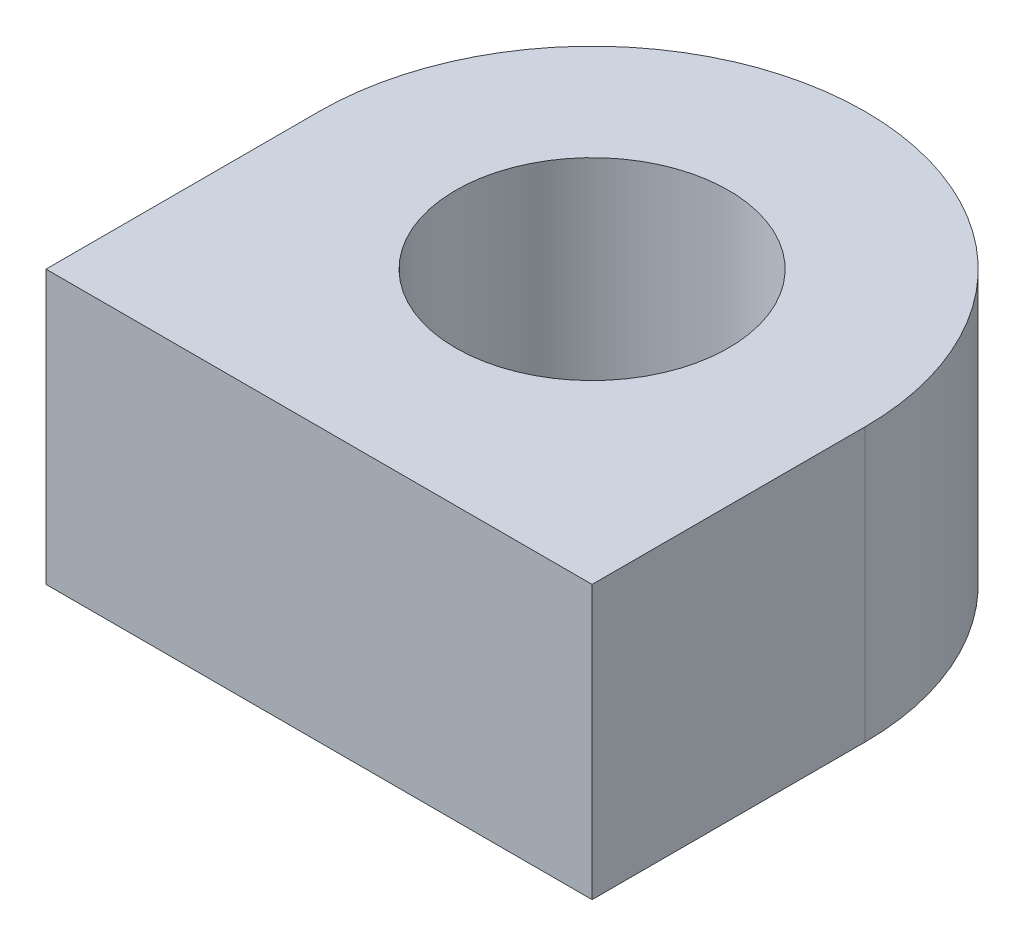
ISO-10303-21;
HEADER;
FILE_DESCRIPTION(('STEP AP214'),'2;1');
FILE_NAME('part.step','',(''),(''),'','','');
FILE_SCHEMA(('AUTOMOTIVE_DESIGN { 1 0 10303 214 1 1 1 1 }'));
ENDSEC;
DATA;
#1=APPLICATION_CONTEXT('core data for automotive mechanical design processes');
#2=APPLICATION_PROTOCOL_DEFINITION('international standard','automotive_design',2000,#1);
#3=PRODUCT_CONTEXT('',#1,'mechanical');
#4=PRODUCT('Part','Part','',(#3));
#5=PRODUCT_RELATED_PRODUCT_CATEGORY('part','',(#4));
#6=PRODUCT_DEFINITION_FORMATION('','',#4);
#7=PRODUCT_DEFINITION_CONTEXT('part definition',#1,'design');
#8=PRODUCT_DEFINITION('design','',#6,#7);
#9=PRODUCT_DEFINITION_SHAPE('','',#8);
#10=(LENGTH_UNIT() NAMED_UNIT(*) SI_UNIT(.MILLI.,.METRE.));
#11=(NAMED_UNIT(*) PLANE_ANGLE_UNIT() SI_UNIT($,.RADIAN.));
#12=(NAMED_UNIT(*) SI_UNIT($,.STERADIAN.) SOLID_ANGLE_UNIT());
#13=UNCERTAINTY_MEASURE_WITH_UNIT(LENGTH_MEASURE(1.E-05),#10,'distance_accuracy_value','');
#14=(GEOMETRIC_REPRESENTATION_CONTEXT(3) GLOBAL_UNCERTAINTY_ASSIGNED_CONTEXT((#13)) GLOBAL_UNIT_ASSIGNED_CONTEXT((#10,
#11,#12)) REPRESENTATION_CONTEXT('',''));
#15=CARTESIAN_POINT('',(0.,0.,0.));
#16=DIRECTION('',(0.,0.,1.));
#17=DIRECTION('',(1.,0.,0.));
#18=AXIS2_PLACEMENT_3D('',#15,#16,#17);
#19=CARTESIAN_POINT('',(0.,1.5875,0.));
#20=DIRECTION('',(0.,1.,0.));
#21=DIRECTION('',(0.,0.,1.));
#22=AXIS2_PLACEMENT_3D('',#19,#20,#21);
#23=PLANE('',#22);
#24=CARTESIAN_POINT('',(0.,1.5875,0.));
#25=DIRECTION('',(0.,1.,0.));
#26=DIRECTION('',(0.,0.,1.));
#27=AXIS2_PLACEMENT_3D('',#24,#25,#26);
#28=CIRCLE('',#27,1.5875);
#29=CARTESIAN_POINT('',(1.5875,1.5875,0.));
#30=VERTEX_POINT('',#29);
#31=CARTESIAN_POINT('',(-1.5875,1.5875,0.));
#32=VERTEX_POINT('',#31);
#33=EDGE_CURVE('E90',#30,#32,#28,.T.);
#34=ORIENTED_EDGE('',*,*,#33,.T.);
#35=DIRECTION('',(0.,0.,1.));
#36=VECTOR('',#35,1.);
#37=CARTESIAN_POINT('',(-1.5875,1.5875,0.));
#38=LINE('',#37,#36);
#39=CARTESIAN_POINT('',(-1.5875,1.5875,1.5875));
#40=VERTEX_POINT('',#39);
#41=EDGE_CURVE('E85',#32,#40,#38,.T.);
#42=ORIENTED_EDGE('',*,*,#41,.T.);
#43=DIRECTION('',(1.,0.,0.));
#44=VECTOR('',#43,1.);
#45=CARTESIAN_POINT('',(-1.5875,1.5875,1.5875));
#46=LINE('',#45,#44);
#47=CARTESIAN_POINT('',(1.5875,1.5875,1.5875));
#48=VERTEX_POINT('',#47);
#49=EDGE_CURVE('E88',#40,#48,#46,.T.);
#50=ORIENTED_EDGE('',*,*,#49,.T.);
#51=DIRECTION('',(0.,0.,-1.));
#52=VECTOR('',#51,1.);
#53=CARTESIAN_POINT('',(1.5875,1.5875,1.5875));
#54=LINE('',#53,#52);
#55=EDGE_CURVE('E56',#48,#30,#54,.T.);
#56=ORIENTED_EDGE('',*,*,#55,.T.);
#57=EDGE_LOOP('',(#34,#42,#50,#56));
#58=FACE_BOUND('',#57,.T.);
#59=CARTESIAN_POINT('',(0.,1.5875,0.));
#60=DIRECTION('',(0.,1.,0.));
#61=DIRECTION('',(0.,0.,1.));
#62=AXIS2_PLACEMENT_3D('',#59,#60,#61);
#63=CIRCLE('',#62,0.793749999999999);
#64=CARTESIAN_POINT('',(0.,1.5875,0.793749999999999));
#65=VERTEX_POINT('',#64);
#66=EDGE_CURVE('E106',#65,#65,#63,.T.);
#67=ORIENTED_EDGE('',*,*,#66,.F.);
#68=EDGE_LOOP('',(#67));
#69=FACE_BOUND('',#68,.T.);
#70=ADVANCED_FACE('F39',(#58,#69),#23,.T.);
#71=CARTESIAN_POINT('',(0.,0.,0.));
#72=DIRECTION('',(0.,1.,0.));
#73=DIRECTION('',(0.,0.,1.));
#74=AXIS2_PLACEMENT_3D('',#71,#72,#73);
#75=PLANE('',#74);
#76=CARTESIAN_POINT('',(0.,0.,0.));
#77=DIRECTION('',(0.,1.,0.));
#78=DIRECTION('',(0.,0.,1.));
#79=AXIS2_PLACEMENT_3D('',#76,#77,#78);
#80=CIRCLE('',#79,1.5875);
#81=CARTESIAN_POINT('',(1.5875,0.,0.));
#82=VERTEX_POINT('',#81);
#83=CARTESIAN_POINT('',(-1.5875,0.,0.));
#84=VERTEX_POINT('',#83);
#85=EDGE_CURVE('E103',#82,#84,#80,.T.);
#86=ORIENTED_EDGE('',*,*,#85,.F.);
#87=DIRECTION('',(0.,0.,-1.));
#88=VECTOR('',#87,1.);
#89=CARTESIAN_POINT('',(1.5875,0.,1.5875));
#90=LINE('',#89,#88);
#91=CARTESIAN_POINT('',(1.5875,0.,1.5875));
#92=VERTEX_POINT('',#91);
#93=EDGE_CURVE('E78',#92,#82,#90,.T.);
#94=ORIENTED_EDGE('',*,*,#93,.F.);
#95=DIRECTION('',(1.,0.,0.));
#96=VECTOR('',#95,1.);
#97=CARTESIAN_POINT('',(0.,0.,1.5875));
#98=LINE('',#97,#96);
#99=CARTESIAN_POINT('',(-1.5875,0.,1.5875));
#100=VERTEX_POINT('',#99);
#101=EDGE_CURVE('E72',#100,#92,#98,.T.);
#102=ORIENTED_EDGE('',*,*,#101,.F.);
#103=DIRECTION('',(0.,0.,1.));
#104=VECTOR('',#103,1.);
#105=CARTESIAN_POINT('',(-1.5875,0.,0.));
#106=LINE('',#105,#104);
#107=EDGE_CURVE('E95',#84,#100,#106,.T.);
#108=ORIENTED_EDGE('',*,*,#107,.F.);
#109=EDGE_LOOP('',(#86,#94,#102,#108));
#110=FACE_BOUND('',#109,.T.);
#111=CARTESIAN_POINT('',(0.,0.,0.));
#112=DIRECTION('',(0.,1.,0.));
#113=DIRECTION('',(0.,0.,1.));
#114=AXIS2_PLACEMENT_3D('',#111,#112,#113);
#115=CIRCLE('',#114,0.793749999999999);
#116=CARTESIAN_POINT('',(0.,0.,0.793749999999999));
#117=VERTEX_POINT('',#116);
#118=EDGE_CURVE('E118',#117,#117,#115,.T.);
#119=ORIENTED_EDGE('',*,*,#118,.T.);
#120=EDGE_LOOP('',(#119));
#121=FACE_BOUND('',#120,.T.);
#122=ADVANCED_FACE('F114',(#110,#121),#75,.F.);
#123=CARTESIAN_POINT('',(0.,1.5875,0.));
#124=DIRECTION('',(0.,-1.,0.));
#125=DIRECTION('',(0.,0.,-1.));
#126=AXIS2_PLACEMENT_3D('',#123,#124,#125);
#127=CYLINDRICAL_SURFACE('',#126,1.5875);
#128=ORIENTED_EDGE('',*,*,#85,.T.);
#129=DIRECTION('',(0.,-1.,0.));
#130=VECTOR('',#129,1.);
#131=CARTESIAN_POINT('',(-1.5875,1.5875,0.));
#132=LINE('',#131,#130);
#133=EDGE_CURVE('E11',#32,#84,#132,.T.);
#134=ORIENTED_EDGE('',*,*,#133,.F.);
#135=ORIENTED_EDGE('',*,*,#33,.F.);
#136=DIRECTION('',(0.,-1.,0.));
#137=VECTOR('',#136,1.);
#138=CARTESIAN_POINT('',(1.5875,1.5875,0.));
#139=LINE('',#138,#137);
#140=EDGE_CURVE('E99',#30,#82,#139,.T.);
#141=ORIENTED_EDGE('',*,*,#140,.T.);
#142=EDGE_LOOP('',(#128,#134,#135,#141));
#143=FACE_BOUND('',#142,.T.);
#144=ADVANCED_FACE('F41',(#143),#127,.T.);
#145=CARTESIAN_POINT('',(-1.5875,1.5875,0.));
#146=DIRECTION('',(1.,0.,0.));
#147=DIRECTION('',(0.,0.,-1.));
#148=AXIS2_PLACEMENT_3D('',#145,#146,#147);
#149=PLANE('',#148);
#150=ORIENTED_EDGE('',*,*,#107,.T.);
#151=DIRECTION('',(0.,-1.,0.));
#152=VECTOR('',#151,1.);
#153=CARTESIAN_POINT('',(-1.5875,1.5875,1.5875));
#154=LINE('',#153,#152);
#155=EDGE_CURVE('E48',#40,#100,#154,.T.);
#156=ORIENTED_EDGE('',*,*,#155,.F.);
#157=ORIENTED_EDGE('',*,*,#41,.F.);
#158=ORIENTED_EDGE('',*,*,#133,.T.);
#159=EDGE_LOOP('',(#150,#156,#157,#158));
#160=FACE_BOUND('',#159,.T.);
#161=ADVANCED_FACE('F94',(#160),#149,.F.);
#162=CARTESIAN_POINT('',(0.,1.5875,1.5875));
#163=DIRECTION('',(0.,0.,-1.));
#164=DIRECTION('',(-1.,0.,0.));
#165=AXIS2_PLACEMENT_3D('',#162,#163,#164);
#166=PLANE('',#165);
#167=ORIENTED_EDGE('',*,*,#101,.T.);
#168=DIRECTION('',(0.,-1.,0.));
#169=VECTOR('',#168,1.);
#170=CARTESIAN_POINT('',(1.5875,1.5875,1.5875));
#171=LINE('',#170,#169);
#172=EDGE_CURVE('E96',#48,#92,#171,.T.);
#173=ORIENTED_EDGE('',*,*,#172,.F.);
#174=ORIENTED_EDGE('',*,*,#49,.F.);
#175=ORIENTED_EDGE('',*,*,#155,.T.);
#176=EDGE_LOOP('',(#167,#173,#174,#175));
#177=FACE_BOUND('',#176,.T.);
#178=ADVANCED_FACE('F97',(#177),#166,.F.);
#179=CARTESIAN_POINT('',(1.5875,1.5875,1.5875));
#180=DIRECTION('',(-1.,0.,0.));
#181=DIRECTION('',(0.,0.,1.));
#182=AXIS2_PLACEMENT_3D('',#179,#180,#181);
#183=PLANE('',#182);
#184=ORIENTED_EDGE('',*,*,#93,.T.);
#185=ORIENTED_EDGE('',*,*,#140,.F.);
#186=ORIENTED_EDGE('',*,*,#55,.F.);
#187=ORIENTED_EDGE('',*,*,#172,.T.);
#188=EDGE_LOOP('',(#184,#185,#186,#187));
#189=FACE_BOUND('',#188,.T.);
#190=ADVANCED_FACE('F111',(#189),#183,.F.);
#191=CARTESIAN_POINT('',(0.,1.5875,0.));
#192=DIRECTION('',(0.,-1.,0.));
#193=DIRECTION('',(0.,0.,-1.));
#194=AXIS2_PLACEMENT_3D('',#191,#192,#193);
#195=CYLINDRICAL_SURFACE('',#194,0.793749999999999);
#196=ORIENTED_EDGE('',*,*,#66,.T.);
#197=EDGE_LOOP('',(#196));
#198=FACE_BOUND('',#197,.T.);
#199=ORIENTED_EDGE('',*,*,#118,.F.);
#200=EDGE_LOOP('',(#199));
#201=FACE_BOUND('',#200,.T.);
#202=ADVANCED_FACE('F124',(#198,#201),#195,.F.);
#203=CLOSED_SHELL('',(#70,#122,#144,#161,#178,#190,#202));
#204=MANIFOLD_SOLID_BREP('B2',#203);
#205=ADVANCED_BREP_SHAPE_REPRESENTATION('',(#18,#204),#14);
#206=SHAPE_DEFINITION_REPRESENTATION(#9,#205);
ENDSEC;
END-ISO-10303-21;
